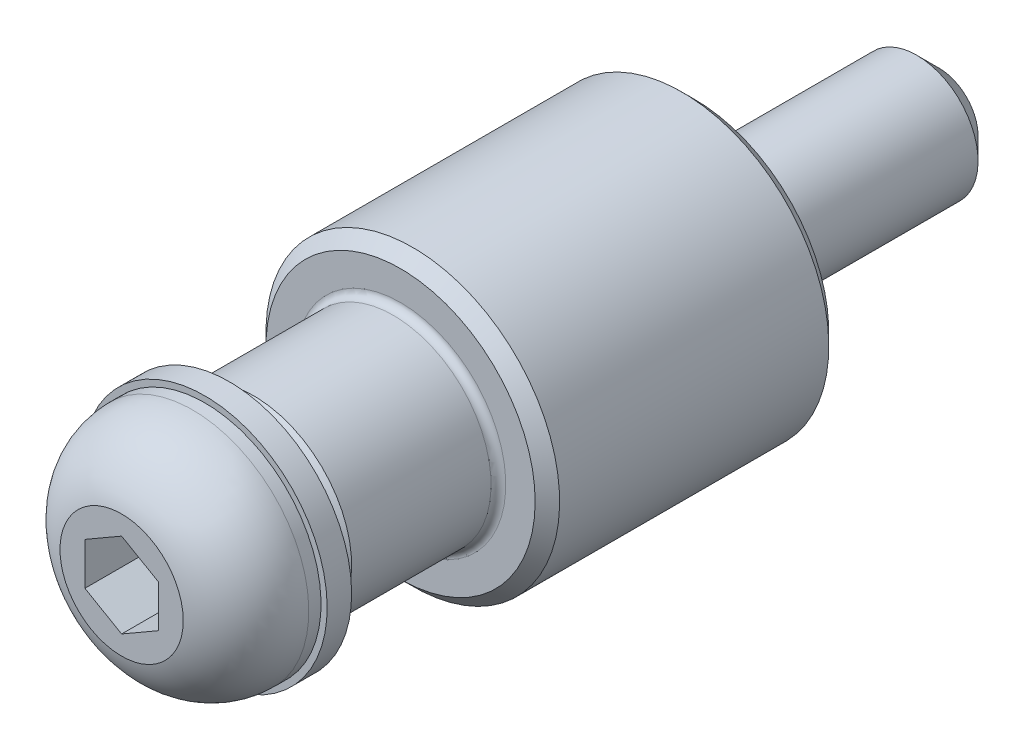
ISO-10303-21;
HEADER;
FILE_DESCRIPTION(('STEP AP214'),'2;1');
FILE_NAME('part.step','',(''),(''),'','','');
FILE_SCHEMA(('AUTOMOTIVE_DESIGN { 1 0 10303 214 1 1 1 1 }'));
ENDSEC;
DATA;
#1=APPLICATION_CONTEXT('core data for automotive mechanical design processes');
#2=APPLICATION_PROTOCOL_DEFINITION('international standard','automotive_design',2000,#1);
#3=PRODUCT_CONTEXT('',#1,'mechanical');
#4=PRODUCT('Part','Part','',(#3));
#5=PRODUCT_RELATED_PRODUCT_CATEGORY('part','',(#4));
#6=PRODUCT_DEFINITION_FORMATION('','',#4);
#7=PRODUCT_DEFINITION_CONTEXT('part definition',#1,'design');
#8=PRODUCT_DEFINITION('design','',#6,#7);
#9=PRODUCT_DEFINITION_SHAPE('','',#8);
#10=(LENGTH_UNIT() NAMED_UNIT(*) SI_UNIT(.MILLI.,.METRE.));
#11=(NAMED_UNIT(*) PLANE_ANGLE_UNIT() SI_UNIT($,.RADIAN.));
#12=(NAMED_UNIT(*) SI_UNIT($,.STERADIAN.) SOLID_ANGLE_UNIT());
#13=UNCERTAINTY_MEASURE_WITH_UNIT(LENGTH_MEASURE(1.E-05),#10,'distance_accuracy_value','');
#14=(GEOMETRIC_REPRESENTATION_CONTEXT(3) GLOBAL_UNCERTAINTY_ASSIGNED_CONTEXT((#13)) GLOBAL_UNIT_ASSIGNED_CONTEXT((#10,
#11,#12)) REPRESENTATION_CONTEXT('',''));
#15=CARTESIAN_POINT('',(0.,0.,0.));
#16=DIRECTION('',(0.,0.,1.));
#17=DIRECTION('',(1.,0.,0.));
#18=AXIS2_PLACEMENT_3D('',#15,#16,#17);
#19=CARTESIAN_POINT('',(1.5,-0.866025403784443,20.4));
#20=DIRECTION('',(0.,0.,1.));
#21=DIRECTION('',(-0.5,-0.866025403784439,0.));
#22=AXIS2_PLACEMENT_3D('',#19,#20,#21);
#23=PLANE('',#22);
#24=DIRECTION('',(0.866025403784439,0.5,0.));
#25=VECTOR('',#24,1.);
#26=CARTESIAN_POINT('',(0.,-1.73205080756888,20.4));
#27=LINE('',#26,#25);
#28=CARTESIAN_POINT('',(0.,-1.73205080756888,20.4));
#29=VERTEX_POINT('',#28);
#30=CARTESIAN_POINT('',(1.5,-0.866025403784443,20.4));
#31=VERTEX_POINT('',#30);
#32=EDGE_CURVE('E101',#29,#31,#27,.T.);
#33=ORIENTED_EDGE('',*,*,#32,.T.);
#34=DIRECTION('',(0.,1.,0.));
#35=VECTOR('',#34,1.);
#36=CARTESIAN_POINT('',(1.5,-0.866025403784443,20.4));
#37=LINE('',#36,#35);
#38=CARTESIAN_POINT('',(1.5,0.866025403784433,20.4));
#39=VERTEX_POINT('',#38);
#40=EDGE_CURVE('E104',#31,#39,#37,.T.);
#41=ORIENTED_EDGE('',*,*,#40,.T.);
#42=DIRECTION('',(-0.866025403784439,0.5,0.));
#43=VECTOR('',#42,1.);
#44=CARTESIAN_POINT('',(1.5,0.866025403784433,20.4));
#45=LINE('',#44,#43);
#46=CARTESIAN_POINT('',(0.,1.73205080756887,20.4));
#47=VERTEX_POINT('',#46);
#48=EDGE_CURVE('E75',#39,#47,#45,.T.);
#49=ORIENTED_EDGE('',*,*,#48,.T.);
#50=DIRECTION('',(-0.866025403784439,-0.5,0.));
#51=VECTOR('',#50,1.);
#52=CARTESIAN_POINT('',(0.,1.73205080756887,20.4));
#53=LINE('',#52,#51);
#54=CARTESIAN_POINT('',(-1.5,0.866025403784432,20.4));
#55=VERTEX_POINT('',#54);
#56=EDGE_CURVE('E107',#47,#55,#53,.T.);
#57=ORIENTED_EDGE('',*,*,#56,.T.);
#58=DIRECTION('',(0.,-1.,0.));
#59=VECTOR('',#58,1.);
#60=CARTESIAN_POINT('',(-1.5,0.866025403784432,20.4));
#61=LINE('',#60,#59);
#62=CARTESIAN_POINT('',(-1.5,-0.866025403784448,20.4));
#63=VERTEX_POINT('',#62);
#64=EDGE_CURVE('E110',#55,#63,#61,.T.);
#65=ORIENTED_EDGE('',*,*,#64,.T.);
#66=DIRECTION('',(0.866025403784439,-0.5,0.));
#67=VECTOR('',#66,1.);
#68=CARTESIAN_POINT('',(-1.5,-0.866025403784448,20.4));
#69=LINE('',#68,#67);
#70=EDGE_CURVE('E113',#63,#29,#69,.T.);
#71=ORIENTED_EDGE('',*,*,#70,.T.);
#72=EDGE_LOOP('',(#33,#41,#49,#57,#65,#71));
#73=FACE_BOUND('',#72,.T.);
#74=ADVANCED_FACE('F14',(#73),#23,.T.);
#75=CARTESIAN_POINT('',(1.5,0.866025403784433,20.4));
#76=DIRECTION('',(0.5,0.866025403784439,0.));
#77=DIRECTION('',(-0.866025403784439,0.5,0.));
#78=AXIS2_PLACEMENT_3D('',#75,#76,#77);
#79=PLANE('',#78);
#80=DIRECTION('',(-0.866025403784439,0.5,0.));
#81=VECTOR('',#80,1.);
#82=CARTESIAN_POINT('',(1.5,0.866025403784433,23.4));
#83=LINE('',#82,#81);
#84=CARTESIAN_POINT('',(1.5,0.866025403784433,23.4));
#85=VERTEX_POINT('',#84);
#86=CARTESIAN_POINT('',(0.,1.73205080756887,23.4));
#87=VERTEX_POINT('',#86);
#88=EDGE_CURVE('E72',#85,#87,#83,.T.);
#89=ORIENTED_EDGE('',*,*,#88,.T.);
#90=DIRECTION('',(0.,0.,1.));
#91=VECTOR('',#90,1.);
#92=CARTESIAN_POINT('',(0.,1.73205080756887,20.4));
#93=LINE('',#92,#91);
#94=EDGE_CURVE('E79',#47,#87,#93,.T.);
#95=ORIENTED_EDGE('',*,*,#94,.F.);
#96=ORIENTED_EDGE('',*,*,#48,.F.);
#97=DIRECTION('',(0.,0.,1.));
#98=VECTOR('',#97,1.);
#99=CARTESIAN_POINT('',(1.5,0.866025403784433,20.4));
#100=LINE('',#99,#98);
#101=EDGE_CURVE('E68',#39,#85,#100,.T.);
#102=ORIENTED_EDGE('',*,*,#101,.T.);
#103=EDGE_LOOP('',(#89,#95,#96,#102));
#104=FACE_BOUND('',#103,.T.);
#105=ADVANCED_FACE('F70',(#104),#79,.F.);
#106=CARTESIAN_POINT('',(0.,1.73205080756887,20.4));
#107=DIRECTION('',(-0.5,0.866025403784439,0.));
#108=DIRECTION('',(-0.866025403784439,-0.5,0.));
#109=AXIS2_PLACEMENT_3D('',#106,#107,#108);
#110=PLANE('',#109);
#111=DIRECTION('',(-0.866025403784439,-0.5,0.));
#112=VECTOR('',#111,1.);
#113=CARTESIAN_POINT('',(0.,1.73205080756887,23.4));
#114=LINE('',#113,#112);
#115=CARTESIAN_POINT('',(-1.5,0.866025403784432,23.4));
#116=VERTEX_POINT('',#115);
#117=EDGE_CURVE('E91',#87,#116,#114,.T.);
#118=ORIENTED_EDGE('',*,*,#117,.T.);
#119=DIRECTION('',(0.,0.,1.));
#120=VECTOR('',#119,1.);
#121=CARTESIAN_POINT('',(-1.5,0.866025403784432,20.4));
#122=LINE('',#121,#120);
#123=EDGE_CURVE('E120',#55,#116,#122,.T.);
#124=ORIENTED_EDGE('',*,*,#123,.F.);
#125=ORIENTED_EDGE('',*,*,#56,.F.);
#126=ORIENTED_EDGE('',*,*,#94,.T.);
#127=EDGE_LOOP('',(#118,#124,#125,#126));
#128=FACE_BOUND('',#127,.T.);
#129=ADVANCED_FACE('F293',(#128),#110,.F.);
#130=CARTESIAN_POINT('',(-1.5,0.866025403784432,20.4));
#131=DIRECTION('',(-1.,0.,0.));
#132=DIRECTION('',(0.,-1.,0.));
#133=AXIS2_PLACEMENT_3D('',#130,#131,#132);
#134=PLANE('',#133);
#135=DIRECTION('',(0.,-1.,0.));
#136=VECTOR('',#135,1.);
#137=CARTESIAN_POINT('',(-1.5,0.866025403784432,23.4));
#138=LINE('',#137,#136);
#139=CARTESIAN_POINT('',(-1.5,-0.866025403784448,23.4));
#140=VERTEX_POINT('',#139);
#141=EDGE_CURVE('E93',#116,#140,#138,.T.);
#142=ORIENTED_EDGE('',*,*,#141,.T.);
#143=DIRECTION('',(0.,0.,1.));
#144=VECTOR('',#143,1.);
#145=CARTESIAN_POINT('',(-1.5,-0.866025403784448,20.4));
#146=LINE('',#145,#144);
#147=EDGE_CURVE('E118',#63,#140,#146,.T.);
#148=ORIENTED_EDGE('',*,*,#147,.F.);
#149=ORIENTED_EDGE('',*,*,#64,.F.);
#150=ORIENTED_EDGE('',*,*,#123,.T.);
#151=EDGE_LOOP('',(#142,#148,#149,#150));
#152=FACE_BOUND('',#151,.T.);
#153=ADVANCED_FACE('F290',(#152),#134,.F.);
#154=CARTESIAN_POINT('',(-1.5,-0.866025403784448,20.4));
#155=DIRECTION('',(-0.5,-0.866025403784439,0.));
#156=DIRECTION('',(0.866025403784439,-0.5,0.));
#157=AXIS2_PLACEMENT_3D('',#154,#155,#156);
#158=PLANE('',#157);
#159=DIRECTION('',(0.866025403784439,-0.5,0.));
#160=VECTOR('',#159,1.);
#161=CARTESIAN_POINT('',(-1.5,-0.866025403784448,23.4));
#162=LINE('',#161,#160);
#163=CARTESIAN_POINT('',(0.,-1.73205080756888,23.4));
#164=VERTEX_POINT('',#163);
#165=EDGE_CURVE('E99',#140,#164,#162,.T.);
#166=ORIENTED_EDGE('',*,*,#165,.T.);
#167=DIRECTION('',(0.,0.,1.));
#168=VECTOR('',#167,1.);
#169=CARTESIAN_POINT('',(0.,-1.73205080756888,20.4));
#170=LINE('',#169,#168);
#171=EDGE_CURVE('E36',#29,#164,#170,.T.);
#172=ORIENTED_EDGE('',*,*,#171,.F.);
#173=ORIENTED_EDGE('',*,*,#70,.F.);
#174=ORIENTED_EDGE('',*,*,#147,.T.);
#175=EDGE_LOOP('',(#166,#172,#173,#174));
#176=FACE_BOUND('',#175,.T.);
#177=ADVANCED_FACE('F286',(#176),#158,.F.);
#178=CARTESIAN_POINT('',(0.,-1.73205080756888,20.4));
#179=DIRECTION('',(0.5,-0.866025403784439,0.));
#180=DIRECTION('',(0.866025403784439,0.5,0.));
#181=AXIS2_PLACEMENT_3D('',#178,#179,#180);
#182=PLANE('',#181);
#183=DIRECTION('',(0.866025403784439,0.5,0.));
#184=VECTOR('',#183,1.);
#185=CARTESIAN_POINT('',(0.,-1.73205080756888,23.4));
#186=LINE('',#185,#184);
#187=CARTESIAN_POINT('',(1.5,-0.866025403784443,23.4));
#188=VERTEX_POINT('',#187);
#189=EDGE_CURVE('E29',#164,#188,#186,.T.);
#190=ORIENTED_EDGE('',*,*,#189,.T.);
#191=DIRECTION('',(0.,0.,1.));
#192=VECTOR('',#191,1.);
#193=CARTESIAN_POINT('',(1.5,-0.866025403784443,20.4));
#194=LINE('',#193,#192);
#195=EDGE_CURVE('E80',#31,#188,#194,.T.);
#196=ORIENTED_EDGE('',*,*,#195,.F.);
#197=ORIENTED_EDGE('',*,*,#32,.F.);
#198=ORIENTED_EDGE('',*,*,#171,.T.);
#199=EDGE_LOOP('',(#190,#196,#197,#198));
#200=FACE_BOUND('',#199,.T.);
#201=ADVANCED_FACE('F289',(#200),#182,.F.);
#202=CARTESIAN_POINT('',(1.5,-0.866025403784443,20.4));
#203=DIRECTION('',(1.,0.,0.));
#204=DIRECTION('',(0.,1.,0.));
#205=AXIS2_PLACEMENT_3D('',#202,#203,#204);
#206=PLANE('',#205);
#207=DIRECTION('',(0.,1.,0.));
#208=VECTOR('',#207,1.);
#209=CARTESIAN_POINT('',(1.5,-0.866025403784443,23.4));
#210=LINE('',#209,#208);
#211=EDGE_CURVE('E83',#188,#85,#210,.T.);
#212=ORIENTED_EDGE('',*,*,#211,.T.);
#213=ORIENTED_EDGE('',*,*,#101,.F.);
#214=ORIENTED_EDGE('',*,*,#40,.F.);
#215=ORIENTED_EDGE('',*,*,#195,.T.);
#216=EDGE_LOOP('',(#212,#213,#214,#215));
#217=FACE_BOUND('',#216,.T.);
#218=ADVANCED_FACE('F84',(#217),#206,.F.);
#219=CARTESIAN_POINT('',(0.,0.,23.4));
#220=DIRECTION('',(0.,0.,-1.));
#221=DIRECTION('',(0.5,0.866025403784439,0.));
#222=AXIS2_PLACEMENT_3D('',#219,#220,#221);
#223=PLANE('',#222);
#224=ORIENTED_EDGE('',*,*,#211,.F.);
#225=ORIENTED_EDGE('',*,*,#189,.F.);
#226=ORIENTED_EDGE('',*,*,#165,.F.);
#227=ORIENTED_EDGE('',*,*,#141,.F.);
#228=ORIENTED_EDGE('',*,*,#117,.F.);
#229=ORIENTED_EDGE('',*,*,#88,.F.);
#230=EDGE_LOOP('',(#224,#225,#226,#227,#228,#229));
#231=FACE_BOUND('',#230,.T.);
#232=CARTESIAN_POINT('',(0.,0.,23.4));
#233=DIRECTION('',(0.,0.,1.));
#234=DIRECTION('',(-0.5,-0.866025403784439,0.));
#235=AXIS2_PLACEMENT_3D('',#232,#233,#234);
#236=CIRCLE('',#235,2.51811457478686);
#237=CARTESIAN_POINT('',(-1.25905728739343,-2.18075119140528,23.4));
#238=VERTEX_POINT('',#237);
#239=EDGE_CURVE('E126',#238,#238,#236,.T.);
#240=ORIENTED_EDGE('',*,*,#239,.T.);
#241=EDGE_LOOP('',(#240));
#242=FACE_BOUND('',#241,.T.);
#243=ADVANCED_FACE('F87',(#231,#242),#223,.F.);
#244=CARTESIAN_POINT('',(0.,0.,20.5));
#245=DIRECTION('',(0.,0.,1.));
#246=DIRECTION('',(-0.5,-0.866025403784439,0.));
#247=AXIS2_PLACEMENT_3D('',#244,#245,#246);
#248=DEGENERATE_TOROIDAL_SURFACE('',#247,1.75,3.,.T.);
#249=ORIENTED_EDGE('',*,*,#239,.F.);
#250=EDGE_LOOP('',(#249));
#251=FACE_BOUND('',#250,.T.);
#252=CARTESIAN_POINT('',(0.,0.,20.5));
#253=DIRECTION('',(0.,0.,1.));
#254=DIRECTION('',(-0.5,-0.866025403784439,0.));
#255=AXIS2_PLACEMENT_3D('',#252,#253,#254);
#256=CIRCLE('',#255,4.75);
#257=CARTESIAN_POINT('',(-2.375,-4.11362066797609,20.5));
#258=VERTEX_POINT('',#257);
#259=EDGE_CURVE('E129',#258,#258,#256,.T.);
#260=ORIENTED_EDGE('',*,*,#259,.T.);
#261=EDGE_LOOP('',(#260));
#262=FACE_BOUND('',#261,.T.);
#263=ADVANCED_FACE('F169',(#251,#262),#248,.T.);
#264=CARTESIAN_POINT('',(0.,0.,23.4));
#265=DIRECTION('',(0.,0.,1.));
#266=DIRECTION('',(-0.5,-0.866025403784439,0.));
#267=AXIS2_PLACEMENT_3D('',#264,#265,#266);
#268=CYLINDRICAL_SURFACE('',#267,4.75);
#269=ORIENTED_EDGE('',*,*,#259,.F.);
#270=EDGE_LOOP('',(#269));
#271=FACE_BOUND('',#270,.T.);
#272=CARTESIAN_POINT('',(0.,0.,20.));
#273=DIRECTION('',(0.,0.,1.));
#274=DIRECTION('',(-0.5,-0.866025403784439,0.));
#275=AXIS2_PLACEMENT_3D('',#272,#273,#274);
#276=CIRCLE('',#275,4.75);
#277=CARTESIAN_POINT('',(-2.375,-4.11362066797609,20.));
#278=VERTEX_POINT('',#277);
#279=EDGE_CURVE('E132',#278,#278,#276,.T.);
#280=ORIENTED_EDGE('',*,*,#279,.T.);
#281=EDGE_LOOP('',(#280));
#282=FACE_BOUND('',#281,.T.);
#283=ADVANCED_FACE('F158',(#271,#282),#268,.T.);
#284=CARTESIAN_POINT('',(0.,0.,23.4));
#285=DIRECTION('',(0.,0.,1.));
#286=DIRECTION('',(-0.5,-0.866025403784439,0.));
#287=AXIS2_PLACEMENT_3D('',#284,#285,#286);
#288=CYLINDRICAL_SURFACE('',#287,2.5);
#289=CARTESIAN_POINT('',(0.,0.,-9.1));
#290=DIRECTION('',(0.,0.,-1.));
#291=DIRECTION('',(0.,1.,0.));
#292=AXIS2_PLACEMENT_3D('',#289,#290,#291);
#293=CIRCLE('',#292,2.5);
#294=CARTESIAN_POINT('',(0.,2.49999999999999,-9.1));
#295=VERTEX_POINT('',#294);
#296=EDGE_CURVE('E9',#295,#295,#293,.F.);
#297=ORIENTED_EDGE('',*,*,#296,.T.);
#298=EDGE_LOOP('',(#297));
#299=FACE_BOUND('',#298,.T.);
#300=CARTESIAN_POINT('',(0.,0.,0.));
#301=DIRECTION('',(0.,0.,-1.));
#302=DIRECTION('',(-0.866025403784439,0.5,0.));
#303=AXIS2_PLACEMENT_3D('',#300,#301,#302);
#304=CIRCLE('',#303,2.5);
#305=CARTESIAN_POINT('',(-2.1650635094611,1.25,0.));
#306=VERTEX_POINT('',#305);
#307=EDGE_CURVE('E135',#306,#306,#304,.T.);
#308=ORIENTED_EDGE('',*,*,#307,.T.);
#309=EDGE_LOOP('',(#308));
#310=FACE_BOUND('',#309,.T.);
#311=ADVANCED_FACE('F155',(#299,#310),#288,.T.);
#312=CARTESIAN_POINT('',(0.,0.,20.));
#313=DIRECTION('',(0.,0.,1.));
#314=DIRECTION('',(-0.5,-0.866025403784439,0.));
#315=AXIS2_PLACEMENT_3D('',#312,#313,#314);
#316=CIRCLE('',#315,2.5);
#317=CARTESIAN_POINT('',(-1.25,-2.1650635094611,20.));
#318=VERTEX_POINT('',#317);
#319=EDGE_CURVE('E117',#318,#318,#316,.T.);
#320=ORIENTED_EDGE('',*,*,#319,.F.);
#321=EDGE_LOOP('',(#320));
#322=FACE_BOUND('',#321,.T.);
#323=CARTESIAN_POINT('',(0.,0.,18.5));
#324=DIRECTION('',(0.,0.,-1.));
#325=DIRECTION('',(-0.866025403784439,0.5,0.));
#326=AXIS2_PLACEMENT_3D('',#323,#324,#325);
#327=CIRCLE('',#326,2.5);
#328=CARTESIAN_POINT('',(-2.1650635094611,1.25,18.5));
#329=VERTEX_POINT('',#328);
#330=EDGE_CURVE('E138',#329,#329,#327,.T.);
#331=ORIENTED_EDGE('',*,*,#330,.F.);
#332=EDGE_LOOP('',(#331));
#333=FACE_BOUND('',#332,.T.);
#334=ADVANCED_FACE('F157',(#322,#333),#288,.T.);
#335=CARTESIAN_POINT('',(1.25,2.1650635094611,20.));
#336=DIRECTION('',(0.,0.,1.));
#337=DIRECTION('',(-0.5,-0.866025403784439,0.));
#338=AXIS2_PLACEMENT_3D('',#335,#336,#337);
#339=PLANE('',#338);
#340=CARTESIAN_POINT('',(0.,0.,20.));
#341=DIRECTION('',(0.,0.,1.));
#342=DIRECTION('',(0.5,0.866025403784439,0.));
#343=AXIS2_PLACEMENT_3D('',#340,#341,#342);
#344=CIRCLE('',#343,2.65);
#345=CARTESIAN_POINT('',(1.325,2.29496732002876,20.));
#346=VERTEX_POINT('',#345);
#347=EDGE_CURVE('E136',#346,#346,#344,.F.);
#348=ORIENTED_EDGE('',*,*,#347,.T.);
#349=EDGE_LOOP('',(#348));
#350=FACE_BOUND('',#349,.T.);
#351=ORIENTED_EDGE('',*,*,#319,.T.);
#352=EDGE_LOOP('',(#351));
#353=FACE_BOUND('',#352,.T.);
#354=ADVANCED_FACE('F166',(#350,#353),#339,.F.);
#355=CARTESIAN_POINT('',(0.,0.,20.));
#356=DIRECTION('',(0.,0.,-1.));
#357=DIRECTION('',(-0.866025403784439,0.5,0.));
#358=AXIS2_PLACEMENT_3D('',#355,#356,#357);
#359=CYLINDRICAL_SURFACE('',#358,5.);
#360=CARTESIAN_POINT('',(0.,0.,20.));
#361=DIRECTION('',(0.,0.,1.));
#362=DIRECTION('',(0.866025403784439,-0.5,0.));
#363=AXIS2_PLACEMENT_3D('',#360,#361,#362);
#364=CIRCLE('',#363,5.);
#365=CARTESIAN_POINT('',(4.3301270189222,-2.5,20.));
#366=VERTEX_POINT('',#365);
#367=EDGE_CURVE('E256',#366,#366,#364,.T.);
#368=ORIENTED_EDGE('',*,*,#367,.F.);
#369=EDGE_LOOP('',(#368));
#370=FACE_BOUND('',#369,.T.);
#371=CARTESIAN_POINT('',(0.,0.,19.));
#372=DIRECTION('',(0.,0.,1.));
#373=DIRECTION('',(0.866025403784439,-0.5,0.));
#374=AXIS2_PLACEMENT_3D('',#371,#372,#373);
#375=CIRCLE('',#374,5.);
#376=CARTESIAN_POINT('',(4.3301270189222,-2.5,19.));
#377=VERTEX_POINT('',#376);
#378=EDGE_CURVE('E253',#377,#377,#375,.T.);
#379=ORIENTED_EDGE('',*,*,#378,.T.);
#380=EDGE_LOOP('',(#379));
#381=FACE_BOUND('',#380,.T.);
#382=ADVANCED_FACE('F262',(#370,#381),#359,.T.);
#383=CARTESIAN_POINT('',(0.,0.,20.));
#384=DIRECTION('',(0.,0.,1.));
#385=DIRECTION('',(0.866025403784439,-0.5,0.));
#386=AXIS2_PLACEMENT_3D('',#383,#384,#385);
#387=PLANE('',#386);
#388=ORIENTED_EDGE('',*,*,#367,.T.);
#389=EDGE_LOOP('',(#388));
#390=FACE_BOUND('',#389,.T.);
#391=ORIENTED_EDGE('',*,*,#279,.F.);
#392=EDGE_LOOP('',(#391));
#393=FACE_BOUND('',#392,.T.);
#394=ADVANCED_FACE('F172',(#390,#393),#387,.T.);
#395=CARTESIAN_POINT('',(0.,0.,19.));
#396=DIRECTION('',(0.,0.,1.));
#397=DIRECTION('',(0.866025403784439,-0.5,0.));
#398=AXIS2_PLACEMENT_3D('',#395,#396,#397);
#399=PLANE('',#398);
#400=ORIENTED_EDGE('',*,*,#378,.F.);
#401=EDGE_LOOP('',(#400));
#402=FACE_BOUND('',#401,.T.);
#403=CARTESIAN_POINT('',(0.,0.,19.));
#404=DIRECTION('',(0.,0.,1.));
#405=DIRECTION('',(0.866025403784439,-0.5,0.));
#406=AXIS2_PLACEMENT_3D('',#403,#404,#405);
#407=CIRCLE('',#406,2.65);
#408=CARTESIAN_POINT('',(2.29496732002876,-1.325,19.));
#409=VERTEX_POINT('',#408);
#410=EDGE_CURVE('E250',#409,#409,#407,.T.);
#411=ORIENTED_EDGE('',*,*,#410,.T.);
#412=EDGE_LOOP('',(#411));
#413=FACE_BOUND('',#412,.T.);
#414=ADVANCED_FACE('F266',(#402,#413),#399,.F.);
#415=CARTESIAN_POINT('',(0.,0.,20.));
#416=DIRECTION('',(0.,0.,-1.));
#417=DIRECTION('',(-0.866025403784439,0.5,0.));
#418=AXIS2_PLACEMENT_3D('',#415,#416,#417);
#419=CYLINDRICAL_SURFACE('',#418,2.65);
#420=ORIENTED_EDGE('',*,*,#347,.F.);
#421=EDGE_LOOP('',(#420));
#422=FACE_BOUND('',#421,.T.);
#423=ORIENTED_EDGE('',*,*,#410,.F.);
#424=EDGE_LOOP('',(#423));
#425=FACE_BOUND('',#424,.T.);
#426=ADVANCED_FACE('F153',(#422,#425),#419,.F.);
#427=CARTESIAN_POINT('',(0.,0.,12.3));
#428=DIRECTION('',(0.,0.,1.));
#429=DIRECTION('',(0.866025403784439,-0.5,0.));
#430=AXIS2_PLACEMENT_3D('',#427,#428,#429);
#431=TOROIDAL_SURFACE('',#430,4.3,0.3);
#432=CARTESIAN_POINT('',(0.,0.,12.3));
#433=DIRECTION('',(0.,0.,1.));
#434=DIRECTION('',(0.866025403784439,-0.5,0.));
#435=AXIS2_PLACEMENT_3D('',#432,#433,#434);
#436=CIRCLE('',#435,4.);
#437=CARTESIAN_POINT('',(3.46410161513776,-2.,12.3));
#438=VERTEX_POINT('',#437);
#439=EDGE_CURVE('E232',#438,#438,#436,.T.);
#440=ORIENTED_EDGE('',*,*,#439,.F.);
#441=EDGE_LOOP('',(#440));
#442=FACE_BOUND('',#441,.T.);
#443=CARTESIAN_POINT('',(0.,0.,12.));
#444=DIRECTION('',(0.,0.,1.));
#445=DIRECTION('',(0.866025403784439,-0.5,0.));
#446=AXIS2_PLACEMENT_3D('',#443,#444,#445);
#447=CIRCLE('',#446,4.3);
#448=CARTESIAN_POINT('',(3.72390923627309,-2.15,12.));
#449=VERTEX_POINT('',#448);
#450=EDGE_CURVE('E241',#449,#449,#447,.F.);
#451=ORIENTED_EDGE('',*,*,#450,.F.);
#452=EDGE_LOOP('',(#451));
#453=FACE_BOUND('',#452,.T.);
#454=ADVANCED_FACE('F168',(#442,#453),#431,.F.);
#455=CARTESIAN_POINT('',(0.,0.,0.));
#456=DIRECTION('',(0.,0.,-1.));
#457=DIRECTION('',(-0.866025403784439,0.5,0.));
#458=AXIS2_PLACEMENT_3D('',#455,#456,#457);
#459=CYLINDRICAL_SURFACE('',#458,4.);
#460=ORIENTED_EDGE('',*,*,#439,.T.);
#461=EDGE_LOOP('',(#460));
#462=FACE_BOUND('',#461,.T.);
#463=CARTESIAN_POINT('',(0.,0.,18.));
#464=DIRECTION('',(0.,0.,1.));
#465=DIRECTION('',(0.866025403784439,-0.5,0.));
#466=AXIS2_PLACEMENT_3D('',#463,#464,#465);
#467=CIRCLE('',#466,4.);
#468=CARTESIAN_POINT('',(3.46410161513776,-2.,18.));
#469=VERTEX_POINT('',#468);
#470=EDGE_CURVE('E235',#469,#469,#467,.F.);
#471=ORIENTED_EDGE('',*,*,#470,.T.);
#472=EDGE_LOOP('',(#471));
#473=FACE_BOUND('',#472,.T.);
#474=ADVANCED_FACE('F208',(#462,#473),#459,.T.);
#475=CARTESIAN_POINT('',(0.,0.,18.));
#476=DIRECTION('',(0.,0.,-1.));
#477=DIRECTION('',(-0.866025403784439,0.5,0.));
#478=AXIS2_PLACEMENT_3D('',#475,#476,#477);
#479=CONICAL_SURFACE('',#478,4.,0.785398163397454);
#480=CARTESIAN_POINT('',(0.,0.,18.5));
#481=DIRECTION('',(0.,0.,1.));
#482=DIRECTION('',(0.866025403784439,-0.5,0.));
#483=AXIS2_PLACEMENT_3D('',#480,#481,#482);
#484=CIRCLE('',#483,3.5);
#485=CARTESIAN_POINT('',(3.03108891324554,-1.75,18.5));
#486=VERTEX_POINT('',#485);
#487=EDGE_CURVE('E237',#486,#486,#484,.T.);
#488=ORIENTED_EDGE('',*,*,#487,.F.);
#489=EDGE_LOOP('',(#488));
#490=FACE_BOUND('',#489,.T.);
#491=ORIENTED_EDGE('',*,*,#470,.F.);
#492=EDGE_LOOP('',(#491));
#493=FACE_BOUND('',#492,.T.);
#494=ADVANCED_FACE('F202',(#490,#493),#479,.T.);
#495=CARTESIAN_POINT('',(2.,3.46410161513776,18.5));
#496=DIRECTION('',(0.,0.,1.));
#497=DIRECTION('',(0.866025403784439,-0.5,0.));
#498=AXIS2_PLACEMENT_3D('',#495,#496,#497);
#499=PLANE('',#498);
#500=ORIENTED_EDGE('',*,*,#487,.T.);
#501=EDGE_LOOP('',(#500));
#502=FACE_BOUND('',#501,.T.);
#503=ORIENTED_EDGE('',*,*,#330,.T.);
#504=EDGE_LOOP('',(#503));
#505=FACE_BOUND('',#504,.T.);
#506=ADVANCED_FACE('F188',(#502,#505),#499,.T.);
#507=CARTESIAN_POINT('',(3.,5.19615242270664,12.));
#508=DIRECTION('',(0.,0.,1.));
#509=DIRECTION('',(0.866025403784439,-0.5,0.));
#510=AXIS2_PLACEMENT_3D('',#507,#508,#509);
#511=PLANE('',#510);
#512=ORIENTED_EDGE('',*,*,#450,.T.);
#513=EDGE_LOOP('',(#512));
#514=FACE_BOUND('',#513,.T.);
#515=CARTESIAN_POINT('',(0.,0.,12.));
#516=DIRECTION('',(0.,0.,1.));
#517=DIRECTION('',(0.866025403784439,-0.5,0.));
#518=AXIS2_PLACEMENT_3D('',#515,#516,#517);
#519=CIRCLE('',#518,5.5);
#520=CARTESIAN_POINT('',(4.76313972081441,-2.75,12.));
#521=VERTEX_POINT('',#520);
#522=EDGE_CURVE('E238',#521,#521,#519,.T.);
#523=ORIENTED_EDGE('',*,*,#522,.T.);
#524=EDGE_LOOP('',(#523));
#525=FACE_BOUND('',#524,.T.);
#526=ADVANCED_FACE('F195',(#514,#525),#511,.T.);
#527=CARTESIAN_POINT('',(0.,0.,11.5));
#528=DIRECTION('',(0.,0.,-1.));
#529=DIRECTION('',(-0.866025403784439,0.5,0.));
#530=AXIS2_PLACEMENT_3D('',#527,#528,#529);
#531=CONICAL_SURFACE('',#530,6.,0.785398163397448);
#532=ORIENTED_EDGE('',*,*,#522,.F.);
#533=EDGE_LOOP('',(#532));
#534=FACE_BOUND('',#533,.T.);
#535=CARTESIAN_POINT('',(0.,0.,11.5));
#536=DIRECTION('',(0.,0.,1.));
#537=DIRECTION('',(0.866025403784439,-0.5,0.));
#538=AXIS2_PLACEMENT_3D('',#535,#536,#537);
#539=CIRCLE('',#538,6.);
#540=CARTESIAN_POINT('',(5.19615242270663,-3.,11.5));
#541=VERTEX_POINT('',#540);
#542=EDGE_CURVE('E474',#541,#541,#539,.F.);
#543=ORIENTED_EDGE('',*,*,#542,.F.);
#544=EDGE_LOOP('',(#543));
#545=FACE_BOUND('',#544,.T.);
#546=ADVANCED_FACE('F187',(#534,#545),#531,.T.);
#547=CARTESIAN_POINT('',(0.,0.,0.));
#548=DIRECTION('',(0.,0.,-1.));
#549=DIRECTION('',(-0.866025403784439,0.5,0.));
#550=AXIS2_PLACEMENT_3D('',#547,#548,#549);
#551=CYLINDRICAL_SURFACE('',#550,6.);
#552=CARTESIAN_POINT('',(0.,0.,0.5));
#553=DIRECTION('',(0.,0.,-1.));
#554=DIRECTION('',(-0.866025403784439,0.5,0.));
#555=AXIS2_PLACEMENT_3D('',#552,#553,#554);
#556=CIRCLE('',#555,6.);
#557=CARTESIAN_POINT('',(-5.19615242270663,3.,0.5));
#558=VERTEX_POINT('',#557);
#559=EDGE_CURVE('E244',#558,#558,#556,.F.);
#560=ORIENTED_EDGE('',*,*,#559,.T.);
#561=EDGE_LOOP('',(#560));
#562=FACE_BOUND('',#561,.T.);
#563=ORIENTED_EDGE('',*,*,#542,.T.);
#564=EDGE_LOOP('',(#563));
#565=FACE_BOUND('',#564,.T.);
#566=ADVANCED_FACE('F180',(#562,#565),#551,.T.);
#567=CARTESIAN_POINT('',(0.,0.,0.));
#568=DIRECTION('',(0.,0.,1.));
#569=DIRECTION('',(0.866025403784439,-0.5,0.));
#570=AXIS2_PLACEMENT_3D('',#567,#568,#569);
#571=CONICAL_SURFACE('',#570,5.5,0.785398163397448);
#572=ORIENTED_EDGE('',*,*,#559,.F.);
#573=EDGE_LOOP('',(#572));
#574=FACE_BOUND('',#573,.T.);
#575=CARTESIAN_POINT('',(0.,0.,0.));
#576=DIRECTION('',(0.,0.,-1.));
#577=DIRECTION('',(-0.866025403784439,0.5,0.));
#578=AXIS2_PLACEMENT_3D('',#575,#576,#577);
#579=CIRCLE('',#578,5.5);
#580=CARTESIAN_POINT('',(-4.76313972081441,2.75,0.));
#581=VERTEX_POINT('',#580);
#582=EDGE_CURVE('E472',#581,#581,#579,.T.);
#583=ORIENTED_EDGE('',*,*,#582,.F.);
#584=EDGE_LOOP('',(#583));
#585=FACE_BOUND('',#584,.T.);
#586=ADVANCED_FACE('F177',(#574,#585),#571,.T.);
#587=CARTESIAN_POINT('',(0.,0.,0.));
#588=DIRECTION('',(0.,0.,-1.));
#589=DIRECTION('',(-0.866025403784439,0.5,0.));
#590=AXIS2_PLACEMENT_3D('',#587,#588,#589);
#591=PLANE('',#590);
#592=ORIENTED_EDGE('',*,*,#582,.T.);
#593=EDGE_LOOP('',(#592));
#594=FACE_BOUND('',#593,.T.);
#595=ORIENTED_EDGE('',*,*,#307,.F.);
#596=EDGE_LOOP('',(#595));
#597=FACE_BOUND('',#596,.T.);
#598=ADVANCED_FACE('F151',(#594,#597),#591,.T.);
#599=CARTESIAN_POINT('',(0.,0.,-10.));
#600=DIRECTION('',(0.,0.,-1.));
#601=DIRECTION('',(-1.,0.,0.));
#602=AXIS2_PLACEMENT_3D('',#599,#600,#601);
#603=PLANE('',#602);
#604=CARTESIAN_POINT('',(0.,0.,-10.));
#605=DIRECTION('',(0.,0.,-1.));
#606=DIRECTION('',(-1.,0.,0.));
#607=AXIS2_PLACEMENT_3D('',#604,#605,#606);
#608=CIRCLE('',#607,1.6);
#609=CARTESIAN_POINT('',(-1.6,0.,-10.));
#610=VERTEX_POINT('',#609);
#611=EDGE_CURVE('E22',#610,#610,#608,.T.);
#612=ORIENTED_EDGE('',*,*,#611,.T.);
#613=EDGE_LOOP('',(#612));
#614=FACE_BOUND('',#613,.T.);
#615=ADVANCED_FACE('F142',(#614),#603,.T.);
#616=CARTESIAN_POINT('',(0.,0.,-10.));
#617=DIRECTION('',(0.,0.,1.));
#618=DIRECTION('',(0.,-1.,0.));
#619=AXIS2_PLACEMENT_3D('',#616,#617,#618);
#620=CONICAL_SURFACE('',#619,1.6,0.785398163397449);
#621=ORIENTED_EDGE('',*,*,#296,.F.);
#622=EDGE_LOOP('',(#621));
#623=FACE_BOUND('',#622,.T.);
#624=ORIENTED_EDGE('',*,*,#611,.F.);
#625=EDGE_LOOP('',(#624));
#626=FACE_BOUND('',#625,.T.);
#627=ADVANCED_FACE('F16',(#623,#626),#620,.T.);
#628=CLOSED_SHELL('',(#74,#105,#129,#153,#177,#201,#218,#243,#263,#283,#311,#334,#354,#382,#394,
#414,#426,#454,#474,#494,#506,#526,#546,#566,#586,#598,#615,#627));
#629=MANIFOLD_SOLID_BREP('B1',#628);
#630=ADVANCED_BREP_SHAPE_REPRESENTATION('',(#18,#629),#14);
#631=SHAPE_DEFINITION_REPRESENTATION(#9,#630);
ENDSEC;
END-ISO-10303-21;
